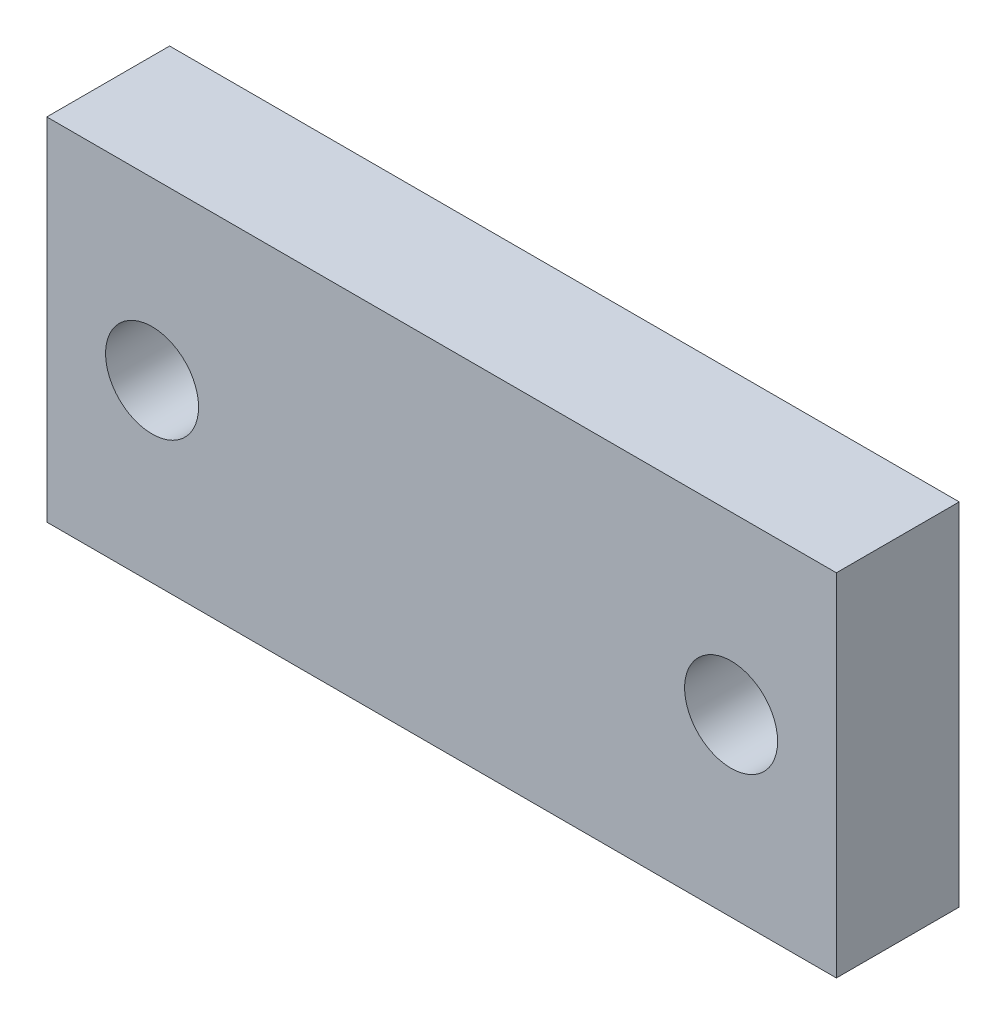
from build123d import *

# Parameters (mm, degrees)
ESQUISSE1_W             = 45
ESQUISSE1_H             = 20
BOSS_EXTRU_1_DEPTH      = 7
ESQUISSE2_R             = 2.65
ENL_V_MAT_EXTRU_1_DEPTH = 7


with BuildPart() as part:
    # Esquisse1 → Boss.-Extru.1 (new body)
    with BuildSketch(Plane.XY):
        with Locations((22.5, -10)):
            Rectangle(ESQUISSE1_W, ESQUISSE1_H)
    extrude(amount=BOSS_EXTRU_1_DEPTH)

    # Esquisse2 → Enl_v. mat.-Extru.1 (cut)
    with BuildSketch(Plane.XY.offset(7)):
        with Locations((6, -10)):
            Circle(ESQUISSE2_R)
        with Locations((39, -10)):
            Circle(ESQUISSE2_R)
    extrude(amount=-ENL_V_MAT_EXTRU_1_DEPTH, mode=Mode.SUBTRACT)


solid = part.part
